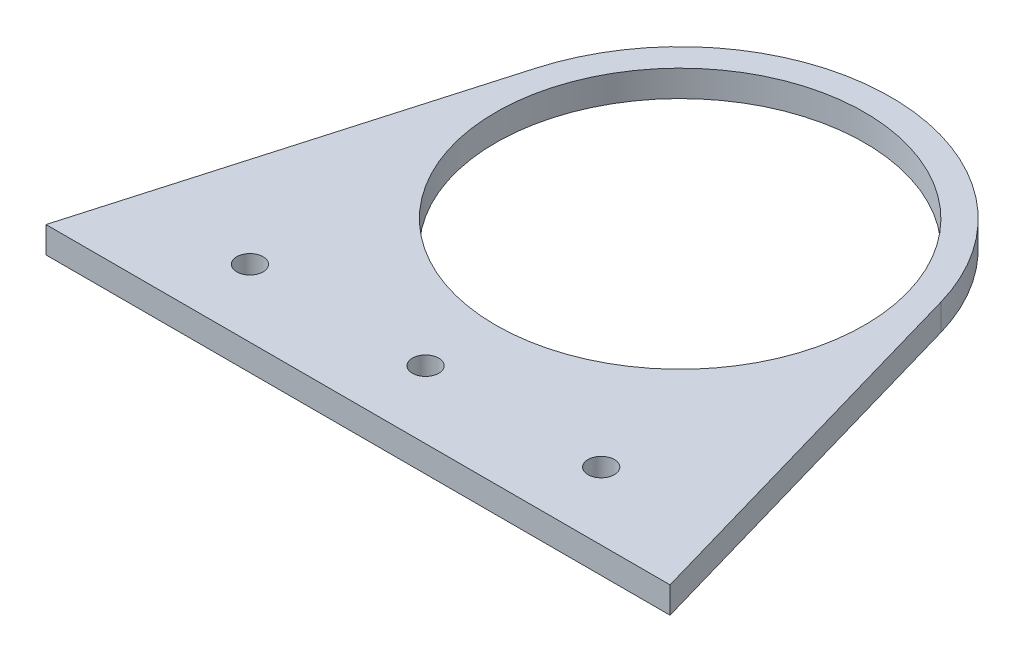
ISO-10303-21;
HEADER;
FILE_DESCRIPTION(('STEP AP214'),'2;1');
FILE_NAME('part.step','',(''),(''),'','','');
FILE_SCHEMA(('AUTOMOTIVE_DESIGN { 1 0 10303 214 1 1 1 1 }'));
ENDSEC;
DATA;
#1=APPLICATION_CONTEXT('core data for automotive mechanical design processes');
#2=APPLICATION_PROTOCOL_DEFINITION('international standard','automotive_design',2000,#1);
#3=PRODUCT_CONTEXT('',#1,'mechanical');
#4=PRODUCT('Part','Part','',(#3));
#5=PRODUCT_RELATED_PRODUCT_CATEGORY('part','',(#4));
#6=PRODUCT_DEFINITION_FORMATION('','',#4);
#7=PRODUCT_DEFINITION_CONTEXT('part definition',#1,'design');
#8=PRODUCT_DEFINITION('design','',#6,#7);
#9=PRODUCT_DEFINITION_SHAPE('','',#8);
#10=(LENGTH_UNIT() NAMED_UNIT(*) SI_UNIT(.MILLI.,.METRE.));
#11=(NAMED_UNIT(*) PLANE_ANGLE_UNIT() SI_UNIT($,.RADIAN.));
#12=(NAMED_UNIT(*) SI_UNIT($,.STERADIAN.) SOLID_ANGLE_UNIT());
#13=UNCERTAINTY_MEASURE_WITH_UNIT(LENGTH_MEASURE(1.E-05),#10,'distance_accuracy_value','');
#14=(GEOMETRIC_REPRESENTATION_CONTEXT(3) GLOBAL_UNCERTAINTY_ASSIGNED_CONTEXT((#13)) GLOBAL_UNIT_ASSIGNED_CONTEXT((#10,
#11,#12)) REPRESENTATION_CONTEXT('',''));
#15=CARTESIAN_POINT('',(0.,0.,0.));
#16=DIRECTION('',(0.,0.,1.));
#17=DIRECTION('',(1.,0.,0.));
#18=AXIS2_PLACEMENT_3D('',#15,#16,#17);
#19=CARTESIAN_POINT('',(18.1901260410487,3.,1.84511110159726));
#20=DIRECTION('',(0.,1.,0.));
#21=DIRECTION('',(0.,0.,1.));
#22=AXIS2_PLACEMENT_3D('',#19,#20,#21);
#23=PLANE('',#22);
#24=CARTESIAN_POINT('',(18.1901260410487,3.,30.8350083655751));
#25=DIRECTION('',(0.,1.,0.));
#26=DIRECTION('',(0.,0.,1.));
#27=AXIS2_PLACEMENT_3D('',#24,#25,#26);
#28=CIRCLE('',#27,1.5);
#29=CARTESIAN_POINT('',(18.1901260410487,3.,32.3350083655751));
#30=VERTEX_POINT('',#29);
#31=EDGE_CURVE('E124',#30,#30,#28,.T.);
#32=ORIENTED_EDGE('',*,*,#31,.F.);
#33=EDGE_LOOP('',(#32));
#34=FACE_BOUND('',#33,.T.);
#35=CARTESIAN_POINT('',(18.1901260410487,3.,1.84511110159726));
#36=DIRECTION('',(0.,1.,0.));
#37=DIRECTION('',(0.,0.,1.));
#38=AXIS2_PLACEMENT_3D('',#35,#36,#37);
#39=CIRCLE('',#38,21.);
#40=CARTESIAN_POINT('',(18.1901260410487,3.,22.8451111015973));
#41=VERTEX_POINT('',#40);
#42=EDGE_CURVE('E103',#41,#41,#39,.T.);
#43=ORIENTED_EDGE('',*,*,#42,.F.);
#44=EDGE_LOOP('',(#43));
#45=FACE_BOUND('',#44,.T.);
#46=CARTESIAN_POINT('',(18.1901260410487,3.,1.84511110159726));
#47=DIRECTION('',(0.,1.,0.));
#48=DIRECTION('',(0.,0.,1.));
#49=AXIS2_PLACEMENT_3D('',#46,#47,#48);
#50=CIRCLE('',#49,24.);
#51=CARTESIAN_POINT('',(41.253821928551,3.,-4.79310643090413));
#52=VERTEX_POINT('',#51);
#53=CARTESIAN_POINT('',(-4.87356984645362,3.,-4.79310643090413));
#54=VERTEX_POINT('',#53);
#55=EDGE_CURVE('E88',#52,#54,#50,.T.);
#56=ORIENTED_EDGE('',*,*,#55,.T.);
#57=DIRECTION('',(-0.276592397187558,0.,0.96098732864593));
#58=VECTOR('',#57,1.);
#59=CARTESIAN_POINT('',(-17.3417219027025,3.,38.5260023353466));
#60=LINE('',#59,#58);
#61=CARTESIAN_POINT('',(-17.3417219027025,3.,38.5260023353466));
#62=VERTEX_POINT('',#61);
#63=EDGE_CURVE('E83',#54,#62,#60,.T.);
#64=ORIENTED_EDGE('',*,*,#63,.T.);
#65=DIRECTION('',(1.,0.,0.));
#66=VECTOR('',#65,1.);
#67=CARTESIAN_POINT('',(-17.3417219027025,3.,38.5260023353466));
#68=LINE('',#67,#66);
#69=CARTESIAN_POINT('',(53.7219739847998,3.,38.5260023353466));
#70=VERTEX_POINT('',#69);
#71=EDGE_CURVE('E86',#62,#70,#68,.T.);
#72=ORIENTED_EDGE('',*,*,#71,.T.);
#73=DIRECTION('',(-0.276592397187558,0.,-0.96098732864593));
#74=VECTOR('',#73,1.);
#75=CARTESIAN_POINT('',(41.253821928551,3.,-4.79310643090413));
#76=LINE('',#75,#74);
#77=EDGE_CURVE('E53',#70,#52,#76,.T.);
#78=ORIENTED_EDGE('',*,*,#77,.T.);
#79=EDGE_LOOP('',(#56,#64,#72,#78));
#80=FACE_BOUND('',#79,.T.);
#81=CARTESIAN_POINT('',(-1.80987395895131,3.,30.8350083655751));
#82=DIRECTION('',(0.,1.,0.));
#83=DIRECTION('',(0.,0.,1.));
#84=AXIS2_PLACEMENT_3D('',#81,#82,#83);
#85=CIRCLE('',#84,1.5);
#86=CARTESIAN_POINT('',(-1.80987395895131,3.,32.3350083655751));
#87=VERTEX_POINT('',#86);
#88=EDGE_CURVE('E118',#87,#87,#85,.T.);
#89=ORIENTED_EDGE('',*,*,#88,.F.);
#90=EDGE_LOOP('',(#89));
#91=FACE_BOUND('',#90,.T.);
#92=CARTESIAN_POINT('',(38.1901260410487,3.,30.8350083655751));
#93=DIRECTION('',(0.,1.,0.));
#94=DIRECTION('',(0.,0.,1.));
#95=AXIS2_PLACEMENT_3D('',#92,#93,#94);
#96=CIRCLE('',#95,1.5);
#97=CARTESIAN_POINT('',(38.1901260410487,3.,32.3350083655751));
#98=VERTEX_POINT('',#97);
#99=EDGE_CURVE('E130',#98,#98,#96,.T.);
#100=ORIENTED_EDGE('',*,*,#99,.F.);
#101=EDGE_LOOP('',(#100));
#102=FACE_BOUND('',#101,.T.);
#103=ADVANCED_FACE('F36',(#34,#45,#80,#91,#102),#23,.T.);
#104=CARTESIAN_POINT('',(18.1901260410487,0.,1.84511110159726));
#105=DIRECTION('',(0.,1.,0.));
#106=DIRECTION('',(0.,0.,1.));
#107=AXIS2_PLACEMENT_3D('',#104,#105,#106);
#108=PLANE('',#107);
#109=CARTESIAN_POINT('',(18.1901260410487,0.,1.84511110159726));
#110=DIRECTION('',(0.,1.,0.));
#111=DIRECTION('',(0.,0.,1.));
#112=AXIS2_PLACEMENT_3D('',#109,#110,#111);
#113=CIRCLE('',#112,24.);
#114=CARTESIAN_POINT('',(41.253821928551,0.,-4.79310643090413));
#115=VERTEX_POINT('',#114);
#116=CARTESIAN_POINT('',(-4.87356984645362,0.,-4.79310643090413));
#117=VERTEX_POINT('',#116);
#118=EDGE_CURVE('E100',#115,#117,#113,.T.);
#119=ORIENTED_EDGE('',*,*,#118,.F.);
#120=DIRECTION('',(-0.276592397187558,0.,-0.96098732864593));
#121=VECTOR('',#120,1.);
#122=CARTESIAN_POINT('',(41.253821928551,0.,-4.79310643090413));
#123=LINE('',#122,#121);
#124=CARTESIAN_POINT('',(53.7219739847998,0.,38.5260023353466));
#125=VERTEX_POINT('',#124);
#126=EDGE_CURVE('E76',#125,#115,#123,.T.);
#127=ORIENTED_EDGE('',*,*,#126,.F.);
#128=DIRECTION('',(1.,0.,0.));
#129=VECTOR('',#128,1.);
#130=CARTESIAN_POINT('',(-17.3417219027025,0.,38.5260023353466));
#131=LINE('',#130,#129);
#132=CARTESIAN_POINT('',(-17.3417219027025,0.,38.5260023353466));
#133=VERTEX_POINT('',#132);
#134=EDGE_CURVE('E70',#133,#125,#131,.T.);
#135=ORIENTED_EDGE('',*,*,#134,.F.);
#136=DIRECTION('',(-0.276592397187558,0.,0.96098732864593));
#137=VECTOR('',#136,1.);
#138=CARTESIAN_POINT('',(-17.3417219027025,0.,38.5260023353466));
#139=LINE('',#138,#137);
#140=EDGE_CURVE('E92',#117,#133,#139,.T.);
#141=ORIENTED_EDGE('',*,*,#140,.F.);
#142=EDGE_LOOP('',(#119,#127,#135,#141));
#143=FACE_BOUND('',#142,.T.);
#144=CARTESIAN_POINT('',(18.1901260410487,0.,1.84511110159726));
#145=DIRECTION('',(0.,1.,0.));
#146=DIRECTION('',(0.,0.,1.));
#147=AXIS2_PLACEMENT_3D('',#144,#145,#146);
#148=CIRCLE('',#147,21.);
#149=CARTESIAN_POINT('',(18.1901260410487,0.,22.8451111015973));
#150=VERTEX_POINT('',#149);
#151=EDGE_CURVE('E115',#150,#150,#148,.T.);
#152=ORIENTED_EDGE('',*,*,#151,.T.);
#153=EDGE_LOOP('',(#152));
#154=FACE_BOUND('',#153,.T.);
#155=CARTESIAN_POINT('',(-1.80987395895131,0.,30.8350083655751));
#156=DIRECTION('',(0.,1.,0.));
#157=DIRECTION('',(0.,0.,1.));
#158=AXIS2_PLACEMENT_3D('',#155,#156,#157);
#159=CIRCLE('',#158,1.5);
#160=CARTESIAN_POINT('',(-1.80987395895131,0.,32.3350083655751));
#161=VERTEX_POINT('',#160);
#162=EDGE_CURVE('E121',#161,#161,#159,.T.);
#163=ORIENTED_EDGE('',*,*,#162,.T.);
#164=EDGE_LOOP('',(#163));
#165=FACE_BOUND('',#164,.T.);
#166=CARTESIAN_POINT('',(18.1901260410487,0.,30.8350083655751));
#167=DIRECTION('',(0.,1.,0.));
#168=DIRECTION('',(0.,0.,1.));
#169=AXIS2_PLACEMENT_3D('',#166,#167,#168);
#170=CIRCLE('',#169,1.5);
#171=CARTESIAN_POINT('',(18.1901260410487,0.,32.3350083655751));
#172=VERTEX_POINT('',#171);
#173=EDGE_CURVE('E127',#172,#172,#170,.T.);
#174=ORIENTED_EDGE('',*,*,#173,.T.);
#175=EDGE_LOOP('',(#174));
#176=FACE_BOUND('',#175,.T.);
#177=CARTESIAN_POINT('',(38.1901260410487,0.,30.8350083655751));
#178=DIRECTION('',(0.,1.,0.));
#179=DIRECTION('',(0.,0.,1.));
#180=AXIS2_PLACEMENT_3D('',#177,#178,#179);
#181=CIRCLE('',#180,1.5);
#182=CARTESIAN_POINT('',(38.1901260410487,0.,32.3350083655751));
#183=VERTEX_POINT('',#182);
#184=EDGE_CURVE('E133',#183,#183,#181,.T.);
#185=ORIENTED_EDGE('',*,*,#184,.T.);
#186=EDGE_LOOP('',(#185));
#187=FACE_BOUND('',#186,.T.);
#188=ADVANCED_FACE('F111',(#143,#154,#165,#176,#187),#108,.F.);
#189=CARTESIAN_POINT('',(18.1901260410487,3.,1.84511110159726));
#190=DIRECTION('',(0.,-1.,0.));
#191=DIRECTION('',(0.,0.,-1.));
#192=AXIS2_PLACEMENT_3D('',#189,#190,#191);
#193=CYLINDRICAL_SURFACE('',#192,24.);
#194=ORIENTED_EDGE('',*,*,#118,.T.);
#195=DIRECTION('',(0.,-1.,0.));
#196=VECTOR('',#195,1.);
#197=CARTESIAN_POINT('',(-4.87356984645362,3.,-4.79310643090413));
#198=LINE('',#197,#196);
#199=EDGE_CURVE('E11',#54,#117,#198,.T.);
#200=ORIENTED_EDGE('',*,*,#199,.F.);
#201=ORIENTED_EDGE('',*,*,#55,.F.);
#202=DIRECTION('',(0.,-1.,0.));
#203=VECTOR('',#202,1.);
#204=CARTESIAN_POINT('',(41.253821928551,3.,-4.79310643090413));
#205=LINE('',#204,#203);
#206=EDGE_CURVE('E96',#52,#115,#205,.T.);
#207=ORIENTED_EDGE('',*,*,#206,.T.);
#208=EDGE_LOOP('',(#194,#200,#201,#207));
#209=FACE_BOUND('',#208,.T.);
#210=ADVANCED_FACE('F38',(#209),#193,.T.);
#211=CARTESIAN_POINT('',(-17.3417219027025,3.,38.5260023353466));
#212=DIRECTION('',(0.96098732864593,0.,0.276592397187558));
#213=DIRECTION('',(0.276592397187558,0.,-0.96098732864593));
#214=AXIS2_PLACEMENT_3D('',#211,#212,#213);
#215=PLANE('',#214);
#216=ORIENTED_EDGE('',*,*,#140,.T.);
#217=DIRECTION('',(0.,-1.,0.));
#218=VECTOR('',#217,1.);
#219=CARTESIAN_POINT('',(-17.3417219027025,3.,38.5260023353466));
#220=LINE('',#219,#218);
#221=EDGE_CURVE('E45',#62,#133,#220,.T.);
#222=ORIENTED_EDGE('',*,*,#221,.F.);
#223=ORIENTED_EDGE('',*,*,#63,.F.);
#224=ORIENTED_EDGE('',*,*,#199,.T.);
#225=EDGE_LOOP('',(#216,#222,#223,#224));
#226=FACE_BOUND('',#225,.T.);
#227=ADVANCED_FACE('F91',(#226),#215,.F.);
#228=CARTESIAN_POINT('',(-17.3417219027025,3.,38.5260023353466));
#229=DIRECTION('',(0.,0.,-1.));
#230=DIRECTION('',(-1.,0.,0.));
#231=AXIS2_PLACEMENT_3D('',#228,#229,#230);
#232=PLANE('',#231);
#233=ORIENTED_EDGE('',*,*,#134,.T.);
#234=DIRECTION('',(0.,-1.,0.));
#235=VECTOR('',#234,1.);
#236=CARTESIAN_POINT('',(53.7219739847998,3.,38.5260023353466));
#237=LINE('',#236,#235);
#238=EDGE_CURVE('E93',#70,#125,#237,.T.);
#239=ORIENTED_EDGE('',*,*,#238,.F.);
#240=ORIENTED_EDGE('',*,*,#71,.F.);
#241=ORIENTED_EDGE('',*,*,#221,.T.);
#242=EDGE_LOOP('',(#233,#239,#240,#241));
#243=FACE_BOUND('',#242,.T.);
#244=ADVANCED_FACE('F94',(#243),#232,.F.);
#245=CARTESIAN_POINT('',(41.253821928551,3.,-4.79310643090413));
#246=DIRECTION('',(-0.96098732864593,0.,0.276592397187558));
#247=DIRECTION('',(0.276592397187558,0.,0.96098732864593));
#248=AXIS2_PLACEMENT_3D('',#245,#246,#247);
#249=PLANE('',#248);
#250=ORIENTED_EDGE('',*,*,#126,.T.);
#251=ORIENTED_EDGE('',*,*,#206,.F.);
#252=ORIENTED_EDGE('',*,*,#77,.F.);
#253=ORIENTED_EDGE('',*,*,#238,.T.);
#254=EDGE_LOOP('',(#250,#251,#252,#253));
#255=FACE_BOUND('',#254,.T.);
#256=ADVANCED_FACE('F108',(#255),#249,.F.);
#257=CARTESIAN_POINT('',(18.1901260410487,3.,1.84511110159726));
#258=DIRECTION('',(0.,-1.,0.));
#259=DIRECTION('',(0.,0.,-1.));
#260=AXIS2_PLACEMENT_3D('',#257,#258,#259);
#261=CYLINDRICAL_SURFACE('',#260,21.);
#262=ORIENTED_EDGE('',*,*,#42,.T.);
#263=EDGE_LOOP('',(#262));
#264=FACE_BOUND('',#263,.T.);
#265=ORIENTED_EDGE('',*,*,#151,.F.);
#266=EDGE_LOOP('',(#265));
#267=FACE_BOUND('',#266,.T.);
#268=ADVANCED_FACE('F152',(#264,#267),#261,.F.);
#269=CARTESIAN_POINT('',(-1.80987395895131,3.,30.8350083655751));
#270=DIRECTION('',(0.,-1.,0.));
#271=DIRECTION('',(0.,0.,-1.));
#272=AXIS2_PLACEMENT_3D('',#269,#270,#271);
#273=CYLINDRICAL_SURFACE('',#272,1.5);
#274=ORIENTED_EDGE('',*,*,#88,.T.);
#275=EDGE_LOOP('',(#274));
#276=FACE_BOUND('',#275,.T.);
#277=ORIENTED_EDGE('',*,*,#162,.F.);
#278=EDGE_LOOP('',(#277));
#279=FACE_BOUND('',#278,.T.);
#280=ADVANCED_FACE('F198',(#276,#279),#273,.F.);
#281=CARTESIAN_POINT('',(18.1901260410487,3.,30.8350083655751));
#282=DIRECTION('',(0.,-1.,0.));
#283=DIRECTION('',(0.,0.,-1.));
#284=AXIS2_PLACEMENT_3D('',#281,#282,#283);
#285=CYLINDRICAL_SURFACE('',#284,1.5);
#286=ORIENTED_EDGE('',*,*,#31,.T.);
#287=EDGE_LOOP('',(#286));
#288=FACE_BOUND('',#287,.T.);
#289=ORIENTED_EDGE('',*,*,#173,.F.);
#290=EDGE_LOOP('',(#289));
#291=FACE_BOUND('',#290,.T.);
#292=ADVANCED_FACE('F206',(#288,#291),#285,.F.);
#293=CARTESIAN_POINT('',(38.1901260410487,3.,30.8350083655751));
#294=DIRECTION('',(0.,-1.,0.));
#295=DIRECTION('',(0.,0.,-1.));
#296=AXIS2_PLACEMENT_3D('',#293,#294,#295);
#297=CYLINDRICAL_SURFACE('',#296,1.5);
#298=ORIENTED_EDGE('',*,*,#99,.T.);
#299=EDGE_LOOP('',(#298));
#300=FACE_BOUND('',#299,.T.);
#301=ORIENTED_EDGE('',*,*,#184,.F.);
#302=EDGE_LOOP('',(#301));
#303=FACE_BOUND('',#302,.T.);
#304=ADVANCED_FACE('F139',(#300,#303),#297,.F.);
#305=CLOSED_SHELL('',(#103,#188,#210,#227,#244,#256,#268,#280,#292,#304));
#306=MANIFOLD_SOLID_BREP('B2',#305);
#307=ADVANCED_BREP_SHAPE_REPRESENTATION('',(#18,#306),#14);
#308=SHAPE_DEFINITION_REPRESENTATION(#9,#307);
ENDSEC;
END-ISO-10303-21;
